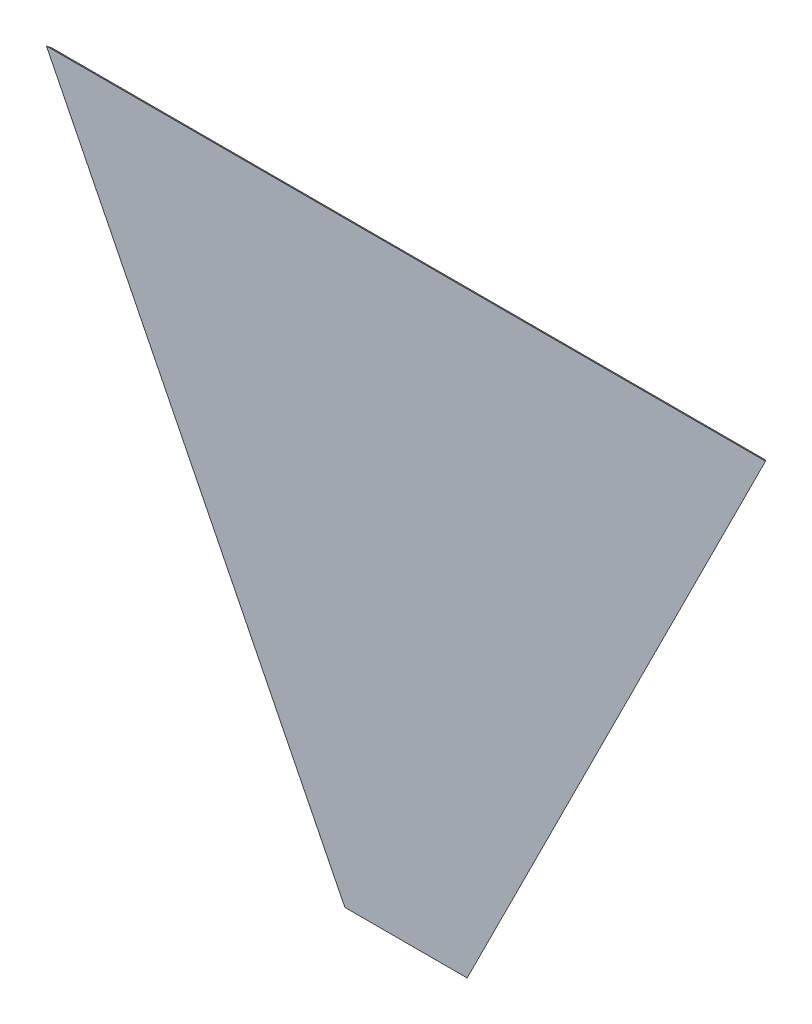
ISO-10303-21;
HEADER;
FILE_DESCRIPTION(('STEP AP214'),'2;1');
FILE_NAME('part.step','',(''),(''),'','','');
FILE_SCHEMA(('AUTOMOTIVE_DESIGN { 1 0 10303 214 1 1 1 1 }'));
ENDSEC;
DATA;
#1=APPLICATION_CONTEXT('core data for automotive mechanical design processes');
#2=APPLICATION_PROTOCOL_DEFINITION('international standard','automotive_design',2000,#1);
#3=PRODUCT_CONTEXT('',#1,'mechanical');
#4=PRODUCT('Part','Part','',(#3));
#5=PRODUCT_RELATED_PRODUCT_CATEGORY('part','',(#4));
#6=PRODUCT_DEFINITION_FORMATION('','',#4);
#7=PRODUCT_DEFINITION_CONTEXT('part definition',#1,'design');
#8=PRODUCT_DEFINITION('design','',#6,#7);
#9=PRODUCT_DEFINITION_SHAPE('','',#8);
#10=(LENGTH_UNIT() NAMED_UNIT(*) SI_UNIT(.MILLI.,.METRE.));
#11=(NAMED_UNIT(*) PLANE_ANGLE_UNIT() SI_UNIT($,.RADIAN.));
#12=(NAMED_UNIT(*) SI_UNIT($,.STERADIAN.) SOLID_ANGLE_UNIT());
#13=UNCERTAINTY_MEASURE_WITH_UNIT(LENGTH_MEASURE(1.E-05),#10,'distance_accuracy_value','');
#14=(GEOMETRIC_REPRESENTATION_CONTEXT(3) GLOBAL_UNCERTAINTY_ASSIGNED_CONTEXT((#13)) GLOBAL_UNIT_ASSIGNED_CONTEXT((#10,
#11,#12)) REPRESENTATION_CONTEXT('',''));
#15=CARTESIAN_POINT('',(0.,0.,0.));
#16=DIRECTION('',(0.,0.,1.));
#17=DIRECTION('',(1.,0.,0.));
#18=AXIS2_PLACEMENT_3D('',#15,#16,#17);
#19=CARTESIAN_POINT('',(-490.0111069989,707.50555349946,13.));
#20=DIRECTION('',(-0.707106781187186,-0.353553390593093,-0.612372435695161));
#21=DIRECTION('',(-0.654653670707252,0.,0.755928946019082));
#22=AXIS2_PLACEMENT_3D('',#19,#20,#21);
#23=PLANE('',#22);
#24=DIRECTION('',(-0.447213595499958,0.894427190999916,0.));
#25=VECTOR('',#24,1.);
#26=CARTESIAN_POINT('',(-136.5470053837,5.773502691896,10.));
#27=LINE('',#26,#25);
#28=CARTESIAN_POINT('',(-136.5470053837,5.773502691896,10.));
#29=VERTEX_POINT('',#28);
#30=CARTESIAN_POINT('',(-836.5470053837,1405.773502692,10.));
#31=VERTEX_POINT('',#30);
#32=EDGE_CURVE('E88',#29,#31,#27,.T.);
#33=ORIENTED_EDGE('',*,*,#32,.F.);
#34=DIRECTION('',(0.707106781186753,-0.353553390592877,-0.612372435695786));
#35=VECTOR('',#34,1.);
#36=CARTESIAN_POINT('',(-143.475208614,9.237604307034,16.));
#37=LINE('',#36,#35);
#38=CARTESIAN_POINT('',(-143.475208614,9.237604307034,16.));
#39=VERTEX_POINT('',#38);
#40=EDGE_CURVE('E71',#39,#29,#37,.T.);
#41=ORIENTED_EDGE('',*,*,#40,.F.);
#42=DIRECTION('',(0.447213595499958,-0.894427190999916,0.));
#43=VECTOR('',#42,1.);
#44=CARTESIAN_POINT('',(-843.475208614,1409.237604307,16.));
#45=LINE('',#44,#43);
#46=CARTESIAN_POINT('',(-843.475208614,1409.237604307,16.));
#47=VERTEX_POINT('',#46);
#48=EDGE_CURVE('E20',#47,#39,#45,.T.);
#49=ORIENTED_EDGE('',*,*,#48,.F.);
#50=DIRECTION('',(-0.707106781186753,0.353553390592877,0.612372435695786));
#51=VECTOR('',#50,1.);
#52=CARTESIAN_POINT('',(-836.5470053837,1405.773502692,10.));
#53=LINE('',#52,#51);
#54=EDGE_CURVE('E10',#31,#47,#53,.T.);
#55=ORIENTED_EDGE('',*,*,#54,.F.);
#56=EDGE_LOOP('',(#33,#41,#49,#55));
#57=FACE_BOUND('',#56,.T.);
#58=ADVANCED_FACE('F16',(#57),#23,.T.);
#59=CARTESIAN_POINT('',(0.,1407.512654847,13.012299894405));
#60=DIRECTION('',(0.,0.866025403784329,-0.50000000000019));
#61=DIRECTION('',(-1.,0.,0.));
#62=AXIS2_PLACEMENT_3D('',#59,#60,#61);
#63=PLANE('',#62);
#64=DIRECTION('',(1.,0.,0.));
#65=VECTOR('',#64,1.);
#66=CARTESIAN_POINT('',(-836.5470053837,1405.773502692,10.));
#67=LINE('',#66,#65);
#68=CARTESIAN_POINT('',(836.54700538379,1405.773502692,10.));
#69=VERTEX_POINT('',#68);
#70=EDGE_CURVE('E94',#31,#69,#67,.T.);
#71=ORIENTED_EDGE('',*,*,#70,.F.);
#72=ORIENTED_EDGE('',*,*,#54,.T.);
#73=DIRECTION('',(-1.,0.,0.));
#74=VECTOR('',#73,1.);
#75=CARTESIAN_POINT('',(843.47520861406,1409.237604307,16.));
#76=LINE('',#75,#74);
#77=CARTESIAN_POINT('',(843.47520861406,1409.237604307,16.));
#78=VERTEX_POINT('',#77);
#79=EDGE_CURVE('E111',#78,#47,#76,.T.);
#80=ORIENTED_EDGE('',*,*,#79,.F.);
#81=DIRECTION('',(0.707106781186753,0.353553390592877,0.612372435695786));
#82=VECTOR('',#81,1.);
#83=CARTESIAN_POINT('',(836.54700538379,1405.773502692,10.));
#84=LINE('',#83,#82);
#85=EDGE_CURVE('E26',#69,#78,#84,.T.);
#86=ORIENTED_EDGE('',*,*,#85,.F.);
#87=EDGE_LOOP('',(#71,#72,#80,#86));
#88=FACE_BOUND('',#87,.T.);
#89=ADVANCED_FACE('F18',(#88),#63,.T.);
#90=CARTESIAN_POINT('',(490.01110699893,707.50555349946,13.));
#91=DIRECTION('',(0.707106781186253,-0.353553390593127,-0.612372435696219));
#92=DIRECTION('',(0.,-0.866025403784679,0.499999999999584));
#93=AXIS2_PLACEMENT_3D('',#90,#91,#92);
#94=PLANE('',#93);
#95=DIRECTION('',(-0.447213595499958,-0.894427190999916,0.));
#96=VECTOR('',#95,1.);
#97=CARTESIAN_POINT('',(836.54700538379,1405.773502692,10.));
#98=LINE('',#97,#96);
#99=CARTESIAN_POINT('',(136.54700538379,5.773502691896,10.));
#100=VERTEX_POINT('',#99);
#101=EDGE_CURVE('E89',#69,#100,#98,.T.);
#102=ORIENTED_EDGE('',*,*,#101,.F.);
#103=ORIENTED_EDGE('',*,*,#85,.T.);
#104=DIRECTION('',(0.447213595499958,0.894427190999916,0.));
#105=VECTOR('',#104,1.);
#106=CARTESIAN_POINT('',(143.47520861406,9.237604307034,16.));
#107=LINE('',#106,#105);
#108=CARTESIAN_POINT('',(143.47520861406,9.237604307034,16.));
#109=VERTEX_POINT('',#108);
#110=EDGE_CURVE('E82',#109,#78,#107,.T.);
#111=ORIENTED_EDGE('',*,*,#110,.F.);
#112=DIRECTION('',(0.707106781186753,0.353553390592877,0.612372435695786));
#113=VECTOR('',#112,1.);
#114=CARTESIAN_POINT('',(136.54700538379,5.773502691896,10.));
#115=LINE('',#114,#113);
#116=EDGE_CURVE('E91',#100,#109,#115,.T.);
#117=ORIENTED_EDGE('',*,*,#116,.F.);
#118=EDGE_LOOP('',(#102,#103,#111,#117));
#119=FACE_BOUND('',#118,.T.);
#120=ADVANCED_FACE('F123',(#119),#94,.T.);
#121=CARTESIAN_POINT('',(0.,901.22897790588,16.));
#122=DIRECTION('',(0.,0.,1.));
#123=DIRECTION('',(1.,0.,0.));
#124=AXIS2_PLACEMENT_3D('',#121,#122,#123);
#125=PLANE('',#124);
#126=DIRECTION('',(1.,0.,0.));
#127=VECTOR('',#126,1.);
#128=CARTESIAN_POINT('',(-143.475208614,9.237604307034,16.));
#129=LINE('',#128,#127);
#130=EDGE_CURVE('E78',#39,#109,#129,.T.);
#131=ORIENTED_EDGE('',*,*,#130,.T.);
#132=ORIENTED_EDGE('',*,*,#110,.T.);
#133=ORIENTED_EDGE('',*,*,#79,.T.);
#134=ORIENTED_EDGE('',*,*,#48,.T.);
#135=EDGE_LOOP('',(#131,#132,#133,#134));
#136=FACE_BOUND('',#135,.T.);
#137=ADVANCED_FACE('F122',(#136),#125,.T.);
#138=CARTESIAN_POINT('',(0.,7.54695848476,13.071715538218));
#139=DIRECTION('',(0.,-0.866025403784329,0.50000000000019));
#140=DIRECTION('',(-1.,0.,0.));
#141=AXIS2_PLACEMENT_3D('',#138,#139,#140);
#142=PLANE('',#141);
#143=DIRECTION('',(-1.,0.,0.));
#144=VECTOR('',#143,1.);
#145=CARTESIAN_POINT('',(136.54700538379,5.773502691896,10.));
#146=LINE('',#145,#144);
#147=EDGE_CURVE('E75',#100,#29,#146,.T.);
#148=ORIENTED_EDGE('',*,*,#147,.F.);
#149=ORIENTED_EDGE('',*,*,#116,.T.);
#150=ORIENTED_EDGE('',*,*,#130,.F.);
#151=ORIENTED_EDGE('',*,*,#40,.T.);
#152=EDGE_LOOP('',(#148,#149,#150,#151));
#153=FACE_BOUND('',#152,.T.);
#154=ADVANCED_FACE('F73',(#153),#142,.T.);
#155=CARTESIAN_POINT('',(0.,898.81292692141,10.));
#156=DIRECTION('',(0.,0.,-1.));
#157=DIRECTION('',(0.,-1.,0.));
#158=AXIS2_PLACEMENT_3D('',#155,#156,#157);
#159=PLANE('',#158);
#160=ORIENTED_EDGE('',*,*,#32,.T.);
#161=ORIENTED_EDGE('',*,*,#70,.T.);
#162=ORIENTED_EDGE('',*,*,#101,.T.);
#163=ORIENTED_EDGE('',*,*,#147,.T.);
#164=EDGE_LOOP('',(#160,#161,#162,#163));
#165=FACE_BOUND('',#164,.T.);
#166=ADVANCED_FACE('F86',(#165),#159,.T.);
#167=CLOSED_SHELL('',(#58,#89,#120,#137,#154,#166));
#168=MANIFOLD_SOLID_BREP('B1',#167);
#169=ADVANCED_BREP_SHAPE_REPRESENTATION('',(#18,#168),#14);
#170=SHAPE_DEFINITION_REPRESENTATION(#9,#169);
ENDSEC;
END-ISO-10303-21;
